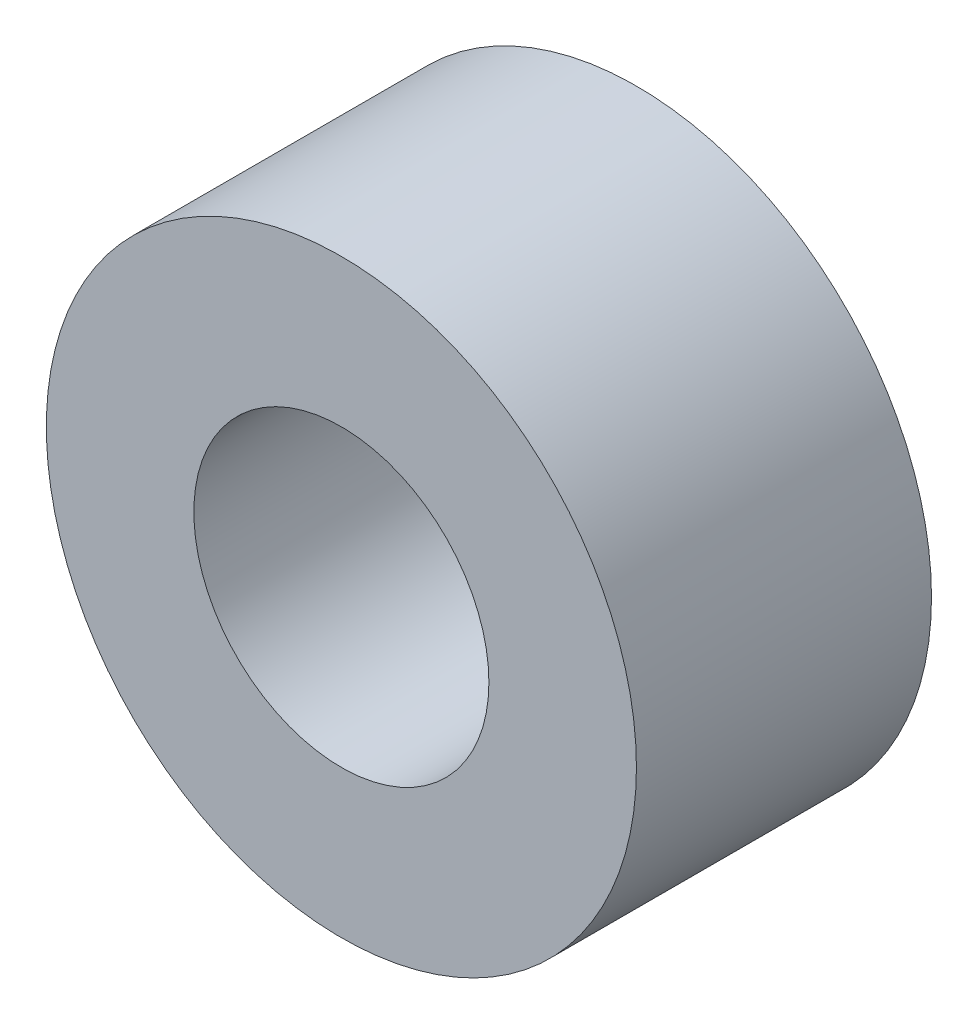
ISO-10303-21;
HEADER;
FILE_DESCRIPTION(('STEP AP214'),'2;1');
FILE_NAME('part.step','',(''),(''),'','','');
FILE_SCHEMA(('AUTOMOTIVE_DESIGN { 1 0 10303 214 1 1 1 1 }'));
ENDSEC;
DATA;
#1=APPLICATION_CONTEXT('core data for automotive mechanical design processes');
#2=APPLICATION_PROTOCOL_DEFINITION('international standard','automotive_design',2000,#1);
#3=PRODUCT_CONTEXT('',#1,'mechanical');
#4=PRODUCT('Part','Part','',(#3));
#5=PRODUCT_RELATED_PRODUCT_CATEGORY('part','',(#4));
#6=PRODUCT_DEFINITION_FORMATION('','',#4);
#7=PRODUCT_DEFINITION_CONTEXT('part definition',#1,'design');
#8=PRODUCT_DEFINITION('design','',#6,#7);
#9=PRODUCT_DEFINITION_SHAPE('','',#8);
#10=(LENGTH_UNIT() NAMED_UNIT(*) SI_UNIT(.MILLI.,.METRE.));
#11=(NAMED_UNIT(*) PLANE_ANGLE_UNIT() SI_UNIT($,.RADIAN.));
#12=(NAMED_UNIT(*) SI_UNIT($,.STERADIAN.) SOLID_ANGLE_UNIT());
#13=UNCERTAINTY_MEASURE_WITH_UNIT(LENGTH_MEASURE(1.E-05),#10,'distance_accuracy_value','');
#14=(GEOMETRIC_REPRESENTATION_CONTEXT(3) GLOBAL_UNCERTAINTY_ASSIGNED_CONTEXT((#13)) GLOBAL_UNIT_ASSIGNED_CONTEXT((#10,
#11,#12)) REPRESENTATION_CONTEXT('',''));
#15=CARTESIAN_POINT('',(0.,0.,0.));
#16=DIRECTION('',(0.,0.,1.));
#17=DIRECTION('',(1.,0.,0.));
#18=AXIS2_PLACEMENT_3D('',#15,#16,#17);
#19=CARTESIAN_POINT('',(0.,0.,0.8));
#20=DIRECTION('',(0.,0.,1.));
#21=DIRECTION('',(1.,0.,0.));
#22=AXIS2_PLACEMENT_3D('',#19,#20,#21);
#23=PLANE('',#22);
#24=CARTESIAN_POINT('',(0.,0.,0.8));
#25=DIRECTION('',(0.,0.,1.));
#26=DIRECTION('',(1.,0.,0.));
#27=AXIS2_PLACEMENT_3D('',#24,#25,#26);
#28=CIRCLE('',#27,0.8);
#29=CARTESIAN_POINT('',(0.8,0.,0.8));
#30=VERTEX_POINT('',#29);
#31=EDGE_CURVE('E10',#30,#30,#28,.T.);
#32=ORIENTED_EDGE('',*,*,#31,.T.);
#33=EDGE_LOOP('',(#32));
#34=FACE_BOUND('',#33,.T.);
#35=CARTESIAN_POINT('',(0.,0.,0.8));
#36=DIRECTION('',(0.,0.,1.));
#37=DIRECTION('',(1.,0.,0.));
#38=AXIS2_PLACEMENT_3D('',#35,#36,#37);
#39=CIRCLE('',#38,0.4);
#40=CARTESIAN_POINT('',(0.4,0.,0.8));
#41=VERTEX_POINT('',#40);
#42=EDGE_CURVE('E40',#41,#41,#39,.T.);
#43=ORIENTED_EDGE('',*,*,#42,.F.);
#44=EDGE_LOOP('',(#43));
#45=FACE_BOUND('',#44,.T.);
#46=ADVANCED_FACE('F29',(#34,#45),#23,.T.);
#47=CARTESIAN_POINT('',(0.,0.,0.));
#48=DIRECTION('',(0.,0.,1.));
#49=DIRECTION('',(1.,0.,0.));
#50=AXIS2_PLACEMENT_3D('',#47,#48,#49);
#51=PLANE('',#50);
#52=CARTESIAN_POINT('',(0.,0.,0.));
#53=DIRECTION('',(0.,0.,1.));
#54=DIRECTION('',(1.,0.,0.));
#55=AXIS2_PLACEMENT_3D('',#52,#53,#54);
#56=CIRCLE('',#55,0.8);
#57=CARTESIAN_POINT('',(0.8,0.,0.));
#58=VERTEX_POINT('',#57);
#59=EDGE_CURVE('E33',#58,#58,#56,.T.);
#60=ORIENTED_EDGE('',*,*,#59,.F.);
#61=EDGE_LOOP('',(#60));
#62=FACE_BOUND('',#61,.T.);
#63=CARTESIAN_POINT('',(0.,0.,0.));
#64=DIRECTION('',(0.,0.,1.));
#65=DIRECTION('',(1.,0.,0.));
#66=AXIS2_PLACEMENT_3D('',#63,#64,#65);
#67=CIRCLE('',#66,0.4);
#68=CARTESIAN_POINT('',(0.4,0.,0.));
#69=VERTEX_POINT('',#68);
#70=EDGE_CURVE('E42',#69,#69,#67,.T.);
#71=ORIENTED_EDGE('',*,*,#70,.T.);
#72=EDGE_LOOP('',(#71));
#73=FACE_BOUND('',#72,.T.);
#74=ADVANCED_FACE('F52',(#62,#73),#51,.F.);
#75=CARTESIAN_POINT('',(0.,0.,0.8));
#76=DIRECTION('',(0.,0.,-1.));
#77=DIRECTION('',(-1.,0.,0.));
#78=AXIS2_PLACEMENT_3D('',#75,#76,#77);
#79=CYLINDRICAL_SURFACE('',#78,0.8);
#80=ORIENTED_EDGE('',*,*,#31,.F.);
#81=EDGE_LOOP('',(#80));
#82=FACE_BOUND('',#81,.T.);
#83=ORIENTED_EDGE('',*,*,#59,.T.);
#84=EDGE_LOOP('',(#83));
#85=FACE_BOUND('',#84,.T.);
#86=ADVANCED_FACE('F31',(#82,#85),#79,.T.);
#87=CARTESIAN_POINT('',(0.,0.,0.8));
#88=DIRECTION('',(0.,0.,-1.));
#89=DIRECTION('',(-1.,0.,0.));
#90=AXIS2_PLACEMENT_3D('',#87,#88,#89);
#91=CYLINDRICAL_SURFACE('',#90,0.4);
#92=ORIENTED_EDGE('',*,*,#42,.T.);
#93=EDGE_LOOP('',(#92));
#94=FACE_BOUND('',#93,.T.);
#95=ORIENTED_EDGE('',*,*,#70,.F.);
#96=EDGE_LOOP('',(#95));
#97=FACE_BOUND('',#96,.T.);
#98=ADVANCED_FACE('F48',(#94,#97),#91,.F.);
#99=CLOSED_SHELL('',(#46,#74,#86,#98));
#100=MANIFOLD_SOLID_BREP('B2',#99);
#101=ADVANCED_BREP_SHAPE_REPRESENTATION('',(#18,#100),#14);
#102=SHAPE_DEFINITION_REPRESENTATION(#9,#101);
ENDSEC;
END-ISO-10303-21;
